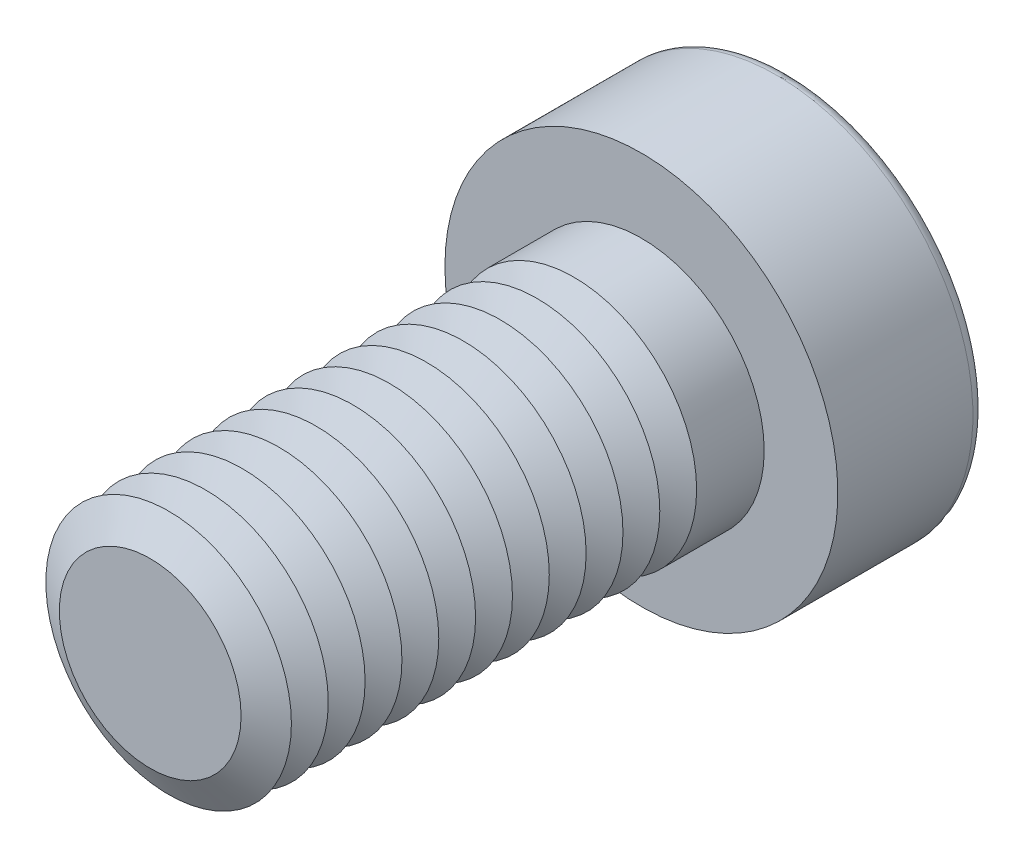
ISO-10303-21;
HEADER;
FILE_DESCRIPTION(('STEP AP214'),'2;1');
FILE_NAME('part.step','',(''),(''),'','','');
FILE_SCHEMA(('AUTOMOTIVE_DESIGN { 1 0 10303 214 1 1 1 1 }'));
ENDSEC;
DATA;
#1=APPLICATION_CONTEXT('core data for automotive mechanical design processes');
#2=APPLICATION_PROTOCOL_DEFINITION('international standard','automotive_design',2000,#1);
#3=PRODUCT_CONTEXT('',#1,'mechanical');
#4=PRODUCT('Part','Part','',(#3));
#5=PRODUCT_RELATED_PRODUCT_CATEGORY('part','',(#4));
#6=PRODUCT_DEFINITION_FORMATION('','',#4);
#7=PRODUCT_DEFINITION_CONTEXT('part definition',#1,'design');
#8=PRODUCT_DEFINITION('design','',#6,#7);
#9=PRODUCT_DEFINITION_SHAPE('','',#8);
#10=(LENGTH_UNIT() NAMED_UNIT(*) SI_UNIT(.MILLI.,.METRE.));
#11=(NAMED_UNIT(*) PLANE_ANGLE_UNIT() SI_UNIT($,.RADIAN.));
#12=(NAMED_UNIT(*) SI_UNIT($,.STERADIAN.) SOLID_ANGLE_UNIT());
#13=UNCERTAINTY_MEASURE_WITH_UNIT(LENGTH_MEASURE(1.E-05),#10,'distance_accuracy_value','');
#14=(GEOMETRIC_REPRESENTATION_CONTEXT(3) GLOBAL_UNCERTAINTY_ASSIGNED_CONTEXT((#13)) GLOBAL_UNIT_ASSIGNED_CONTEXT((#10,
#11,#12)) REPRESENTATION_CONTEXT('',''));
#15=CARTESIAN_POINT('',(0.,0.,0.));
#16=DIRECTION('',(0.,0.,1.));
#17=DIRECTION('',(1.,0.,0.));
#18=AXIS2_PLACEMENT_3D('',#15,#16,#17);
#19=CARTESIAN_POINT('',(0.,0.,14.75));
#20=DIRECTION('',(0.,0.,1.));
#21=DIRECTION('',(1.,0.,0.));
#22=AXIS2_PLACEMENT_3D('',#19,#20,#21);
#23=CONICAL_SURFACE('',#22,5.,1.0471975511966);
#24=CARTESIAN_POINT('',(0.,0.,14.));
#25=DIRECTION('',(0.,0.,1.));
#26=DIRECTION('',(1.,0.,0.));
#27=AXIS2_PLACEMENT_3D('',#24,#25,#26);
#28=CIRCLE('',#27,3.70096189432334);
#29=CARTESIAN_POINT('',(3.70096189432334,0.,14.));
#30=VERTEX_POINT('',#29);
#31=EDGE_CURVE('E311',#30,#30,#28,.T.);
#32=ORIENTED_EDGE('',*,*,#31,.T.);
#33=EDGE_LOOP('',(#32));
#34=FACE_BOUND('',#33,.T.);
#35=CARTESIAN_POINT('',(0.,0.,14.75));
#36=DIRECTION('',(0.,0.,1.));
#37=DIRECTION('',(1.,0.,0.));
#38=AXIS2_PLACEMENT_3D('',#35,#36,#37);
#39=CIRCLE('',#38,5.);
#40=CARTESIAN_POINT('',(5.,0.,14.75));
#41=VERTEX_POINT('',#40);
#42=EDGE_CURVE('E314',#41,#41,#39,.T.);
#43=ORIENTED_EDGE('',*,*,#42,.F.);
#44=EDGE_LOOP('',(#43));
#45=FACE_BOUND('',#44,.T.);
#46=ADVANCED_FACE('F39',(#34,#45),#23,.T.);
#47=CARTESIAN_POINT('',(0.,0.,14.));
#48=DIRECTION('',(0.,0.,-1.));
#49=DIRECTION('',(-1.,0.,0.));
#50=AXIS2_PLACEMENT_3D('',#47,#48,#49);
#51=CONICAL_SURFACE('',#50,3.70096189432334,1.0471975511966);
#52=CARTESIAN_POINT('',(0.,0.,13.25));
#53=DIRECTION('',(0.,0.,1.));
#54=DIRECTION('',(1.,0.,0.));
#55=AXIS2_PLACEMENT_3D('',#52,#53,#54);
#56=CIRCLE('',#55,5.);
#57=CARTESIAN_POINT('',(5.,0.,13.25));
#58=VERTEX_POINT('',#57);
#59=EDGE_CURVE('E322',#58,#58,#56,.T.);
#60=ORIENTED_EDGE('',*,*,#59,.T.);
#61=EDGE_LOOP('',(#60));
#62=FACE_BOUND('',#61,.T.);
#63=ORIENTED_EDGE('',*,*,#31,.F.);
#64=EDGE_LOOP('',(#63));
#65=FACE_BOUND('',#64,.T.);
#66=ADVANCED_FACE('F244',(#62,#65),#51,.T.);
#67=CARTESIAN_POINT('',(0.,0.,20.));
#68=DIRECTION('',(0.,0.,1.));
#69=DIRECTION('',(1.,0.,0.));
#70=AXIS2_PLACEMENT_3D('',#67,#68,#69);
#71=PLANE('',#70);
#72=CARTESIAN_POINT('',(0.,0.,20.));
#73=DIRECTION('',(0.,0.,1.));
#74=DIRECTION('',(1.,0.,0.));
#75=AXIS2_PLACEMENT_3D('',#72,#73,#74);
#76=CIRCLE('',#75,3.70096189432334);
#77=CARTESIAN_POINT('',(3.70096189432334,0.,20.));
#78=VERTEX_POINT('',#77);
#79=EDGE_CURVE('E173',#78,#78,#76,.T.);
#80=ORIENTED_EDGE('',*,*,#79,.T.);
#81=EDGE_LOOP('',(#80));
#82=FACE_BOUND('',#81,.T.);
#83=ADVANCED_FACE('F250',(#82),#71,.T.);
#84=CARTESIAN_POINT('',(0.,0.,20.));
#85=DIRECTION('',(0.,0.,-1.));
#86=DIRECTION('',(-1.,0.,0.));
#87=AXIS2_PLACEMENT_3D('',#84,#85,#86);
#88=CONICAL_SURFACE('',#87,3.70096189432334,1.0471975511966);
#89=CARTESIAN_POINT('',(0.,0.,19.25));
#90=DIRECTION('',(0.,0.,1.));
#91=DIRECTION('',(1.,0.,0.));
#92=AXIS2_PLACEMENT_3D('',#89,#90,#91);
#93=CIRCLE('',#92,5.);
#94=CARTESIAN_POINT('',(5.,0.,19.25));
#95=VERTEX_POINT('',#94);
#96=EDGE_CURVE('E290',#95,#95,#93,.T.);
#97=ORIENTED_EDGE('',*,*,#96,.T.);
#98=EDGE_LOOP('',(#97));
#99=FACE_BOUND('',#98,.T.);
#100=ORIENTED_EDGE('',*,*,#79,.F.);
#101=EDGE_LOOP('',(#100));
#102=FACE_BOUND('',#101,.T.);
#103=ADVANCED_FACE('F198',(#99,#102),#88,.T.);
#104=CARTESIAN_POINT('',(0.,0.,19.25));
#105=DIRECTION('',(0.,0.,1.));
#106=DIRECTION('',(1.,0.,0.));
#107=AXIS2_PLACEMENT_3D('',#104,#105,#106);
#108=CONICAL_SURFACE('',#107,5.,1.0471975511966);
#109=CARTESIAN_POINT('',(0.,0.,18.5));
#110=DIRECTION('',(0.,0.,1.));
#111=DIRECTION('',(1.,0.,0.));
#112=AXIS2_PLACEMENT_3D('',#109,#110,#111);
#113=CIRCLE('',#112,3.70096189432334);
#114=CARTESIAN_POINT('',(3.70096189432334,0.,18.5));
#115=VERTEX_POINT('',#114);
#116=EDGE_CURVE('E287',#115,#115,#113,.T.);
#117=ORIENTED_EDGE('',*,*,#116,.T.);
#118=EDGE_LOOP('',(#117));
#119=FACE_BOUND('',#118,.T.);
#120=ORIENTED_EDGE('',*,*,#96,.F.);
#121=EDGE_LOOP('',(#120));
#122=FACE_BOUND('',#121,.T.);
#123=ADVANCED_FACE('F276',(#119,#122),#108,.T.);
#124=CARTESIAN_POINT('',(0.,0.,18.5));
#125=DIRECTION('',(0.,0.,-1.));
#126=DIRECTION('',(-1.,0.,0.));
#127=AXIS2_PLACEMENT_3D('',#124,#125,#126);
#128=CONICAL_SURFACE('',#127,3.70096189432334,1.0471975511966);
#129=CARTESIAN_POINT('',(0.,0.,17.75));
#130=DIRECTION('',(0.,0.,1.));
#131=DIRECTION('',(1.,0.,0.));
#132=AXIS2_PLACEMENT_3D('',#129,#130,#131);
#133=CIRCLE('',#132,5.);
#134=CARTESIAN_POINT('',(5.,0.,17.75));
#135=VERTEX_POINT('',#134);
#136=EDGE_CURVE('E297',#135,#135,#133,.T.);
#137=ORIENTED_EDGE('',*,*,#136,.T.);
#138=EDGE_LOOP('',(#137));
#139=FACE_BOUND('',#138,.T.);
#140=ORIENTED_EDGE('',*,*,#116,.F.);
#141=EDGE_LOOP('',(#140));
#142=FACE_BOUND('',#141,.T.);
#143=ADVANCED_FACE('F273',(#139,#142),#128,.T.);
#144=CARTESIAN_POINT('',(0.,0.,17.75));
#145=DIRECTION('',(0.,0.,1.));
#146=DIRECTION('',(1.,0.,0.));
#147=AXIS2_PLACEMENT_3D('',#144,#145,#146);
#148=CONICAL_SURFACE('',#147,5.,1.0471975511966);
#149=CARTESIAN_POINT('',(0.,0.,17.));
#150=DIRECTION('',(0.,0.,1.));
#151=DIRECTION('',(1.,0.,0.));
#152=AXIS2_PLACEMENT_3D('',#149,#150,#151);
#153=CIRCLE('',#152,3.70096189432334);
#154=CARTESIAN_POINT('',(3.70096189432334,0.,17.));
#155=VERTEX_POINT('',#154);
#156=EDGE_CURVE('E292',#155,#155,#153,.T.);
#157=ORIENTED_EDGE('',*,*,#156,.T.);
#158=EDGE_LOOP('',(#157));
#159=FACE_BOUND('',#158,.T.);
#160=ORIENTED_EDGE('',*,*,#136,.F.);
#161=EDGE_LOOP('',(#160));
#162=FACE_BOUND('',#161,.T.);
#163=ADVANCED_FACE('F269',(#159,#162),#148,.T.);
#164=CARTESIAN_POINT('',(0.,0.,17.));
#165=DIRECTION('',(0.,0.,-1.));
#166=DIRECTION('',(-1.,0.,0.));
#167=AXIS2_PLACEMENT_3D('',#164,#165,#166);
#168=CONICAL_SURFACE('',#167,3.70096189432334,1.0471975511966);
#169=CARTESIAN_POINT('',(0.,0.,16.25));
#170=DIRECTION('',(0.,0.,1.));
#171=DIRECTION('',(1.,0.,0.));
#172=AXIS2_PLACEMENT_3D('',#169,#170,#171);
#173=CIRCLE('',#172,5.);
#174=CARTESIAN_POINT('',(5.,0.,16.25));
#175=VERTEX_POINT('',#174);
#176=EDGE_CURVE('E307',#175,#175,#173,.T.);
#177=ORIENTED_EDGE('',*,*,#176,.T.);
#178=EDGE_LOOP('',(#177));
#179=FACE_BOUND('',#178,.T.);
#180=ORIENTED_EDGE('',*,*,#156,.F.);
#181=EDGE_LOOP('',(#180));
#182=FACE_BOUND('',#181,.T.);
#183=ADVANCED_FACE('F265',(#179,#182),#168,.T.);
#184=CARTESIAN_POINT('',(0.,0.,16.25));
#185=DIRECTION('',(0.,0.,1.));
#186=DIRECTION('',(1.,0.,0.));
#187=AXIS2_PLACEMENT_3D('',#184,#185,#186);
#188=CONICAL_SURFACE('',#187,5.,1.0471975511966);
#189=CARTESIAN_POINT('',(0.,0.,15.5));
#190=DIRECTION('',(0.,0.,1.));
#191=DIRECTION('',(1.,0.,0.));
#192=AXIS2_PLACEMENT_3D('',#189,#190,#191);
#193=CIRCLE('',#192,3.70096189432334);
#194=CARTESIAN_POINT('',(3.70096189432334,0.,15.5));
#195=VERTEX_POINT('',#194);
#196=EDGE_CURVE('E303',#195,#195,#193,.T.);
#197=ORIENTED_EDGE('',*,*,#196,.T.);
#198=EDGE_LOOP('',(#197));
#199=FACE_BOUND('',#198,.T.);
#200=ORIENTED_EDGE('',*,*,#176,.F.);
#201=EDGE_LOOP('',(#200));
#202=FACE_BOUND('',#201,.T.);
#203=ADVANCED_FACE('F261',(#199,#202),#188,.T.);
#204=CARTESIAN_POINT('',(0.,0.,15.5));
#205=DIRECTION('',(0.,0.,-1.));
#206=DIRECTION('',(-1.,0.,0.));
#207=AXIS2_PLACEMENT_3D('',#204,#205,#206);
#208=CONICAL_SURFACE('',#207,3.70096189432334,1.0471975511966);
#209=ORIENTED_EDGE('',*,*,#42,.T.);
#210=EDGE_LOOP('',(#209));
#211=FACE_BOUND('',#210,.T.);
#212=ORIENTED_EDGE('',*,*,#196,.F.);
#213=EDGE_LOOP('',(#212));
#214=FACE_BOUND('',#213,.T.);
#215=ADVANCED_FACE('F257',(#211,#214),#208,.T.);
#216=CARTESIAN_POINT('',(0.,0.,13.25));
#217=DIRECTION('',(0.,0.,1.));
#218=DIRECTION('',(1.,0.,0.));
#219=AXIS2_PLACEMENT_3D('',#216,#217,#218);
#220=CONICAL_SURFACE('',#219,5.,1.0471975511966);
#221=CARTESIAN_POINT('',(0.,0.,12.5));
#222=DIRECTION('',(0.,0.,1.));
#223=DIRECTION('',(1.,0.,0.));
#224=AXIS2_PLACEMENT_3D('',#221,#222,#223);
#225=CIRCLE('',#224,3.70096189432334);
#226=CARTESIAN_POINT('',(3.70096189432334,0.,12.5));
#227=VERTEX_POINT('',#226);
#228=EDGE_CURVE('E318',#227,#227,#225,.T.);
#229=ORIENTED_EDGE('',*,*,#228,.T.);
#230=EDGE_LOOP('',(#229));
#231=FACE_BOUND('',#230,.T.);
#232=ORIENTED_EDGE('',*,*,#59,.F.);
#233=EDGE_LOOP('',(#232));
#234=FACE_BOUND('',#233,.T.);
#235=ADVANCED_FACE('F260',(#231,#234),#220,.T.);
#236=CARTESIAN_POINT('',(0.,0.,12.5));
#237=DIRECTION('',(0.,0.,-1.));
#238=DIRECTION('',(-1.,0.,0.));
#239=AXIS2_PLACEMENT_3D('',#236,#237,#238);
#240=CONICAL_SURFACE('',#239,3.70096189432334,1.0471975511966);
#241=CARTESIAN_POINT('',(0.,0.,11.75));
#242=DIRECTION('',(0.,0.,1.));
#243=DIRECTION('',(1.,0.,0.));
#244=AXIS2_PLACEMENT_3D('',#241,#242,#243);
#245=CIRCLE('',#244,5.);
#246=CARTESIAN_POINT('',(5.,0.,11.75));
#247=VERTEX_POINT('',#246);
#248=EDGE_CURVE('E330',#247,#247,#245,.T.);
#249=ORIENTED_EDGE('',*,*,#248,.T.);
#250=EDGE_LOOP('',(#249));
#251=FACE_BOUND('',#250,.T.);
#252=ORIENTED_EDGE('',*,*,#228,.F.);
#253=EDGE_LOOP('',(#252));
#254=FACE_BOUND('',#253,.T.);
#255=ADVANCED_FACE('F431',(#251,#254),#240,.T.);
#256=CARTESIAN_POINT('',(0.,0.,11.75));
#257=DIRECTION('',(0.,0.,1.));
#258=DIRECTION('',(1.,0.,0.));
#259=AXIS2_PLACEMENT_3D('',#256,#257,#258);
#260=CONICAL_SURFACE('',#259,5.,1.0471975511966);
#261=CARTESIAN_POINT('',(0.,0.,11.));
#262=DIRECTION('',(0.,0.,1.));
#263=DIRECTION('',(1.,0.,0.));
#264=AXIS2_PLACEMENT_3D('',#261,#262,#263);
#265=CIRCLE('',#264,3.70096189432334);
#266=CARTESIAN_POINT('',(3.70096189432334,0.,11.));
#267=VERTEX_POINT('',#266);
#268=EDGE_CURVE('E326',#267,#267,#265,.T.);
#269=ORIENTED_EDGE('',*,*,#268,.T.);
#270=EDGE_LOOP('',(#269));
#271=FACE_BOUND('',#270,.T.);
#272=ORIENTED_EDGE('',*,*,#248,.F.);
#273=EDGE_LOOP('',(#272));
#274=FACE_BOUND('',#273,.T.);
#275=ADVANCED_FACE('F427',(#271,#274),#260,.T.);
#276=CARTESIAN_POINT('',(0.,0.,11.));
#277=DIRECTION('',(0.,0.,-1.));
#278=DIRECTION('',(-1.,0.,0.));
#279=AXIS2_PLACEMENT_3D('',#276,#277,#278);
#280=CONICAL_SURFACE('',#279,3.70096189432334,1.0471975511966);
#281=CARTESIAN_POINT('',(0.,0.,10.25));
#282=DIRECTION('',(0.,0.,1.));
#283=DIRECTION('',(1.,0.,0.));
#284=AXIS2_PLACEMENT_3D('',#281,#282,#283);
#285=CIRCLE('',#284,5.);
#286=CARTESIAN_POINT('',(5.,0.,10.25));
#287=VERTEX_POINT('',#286);
#288=EDGE_CURVE('E338',#287,#287,#285,.T.);
#289=ORIENTED_EDGE('',*,*,#288,.T.);
#290=EDGE_LOOP('',(#289));
#291=FACE_BOUND('',#290,.T.);
#292=ORIENTED_EDGE('',*,*,#268,.F.);
#293=EDGE_LOOP('',(#292));
#294=FACE_BOUND('',#293,.T.);
#295=ADVANCED_FACE('F423',(#291,#294),#280,.T.);
#296=CARTESIAN_POINT('',(0.,0.,10.25));
#297=DIRECTION('',(0.,0.,1.));
#298=DIRECTION('',(1.,0.,0.));
#299=AXIS2_PLACEMENT_3D('',#296,#297,#298);
#300=CONICAL_SURFACE('',#299,5.,1.0471975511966);
#301=CARTESIAN_POINT('',(0.,0.,9.5));
#302=DIRECTION('',(0.,0.,1.));
#303=DIRECTION('',(1.,0.,0.));
#304=AXIS2_PLACEMENT_3D('',#301,#302,#303);
#305=CIRCLE('',#304,3.70096189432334);
#306=CARTESIAN_POINT('',(3.70096189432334,0.,9.5));
#307=VERTEX_POINT('',#306);
#308=EDGE_CURVE('E334',#307,#307,#305,.T.);
#309=ORIENTED_EDGE('',*,*,#308,.T.);
#310=EDGE_LOOP('',(#309));
#311=FACE_BOUND('',#310,.T.);
#312=ORIENTED_EDGE('',*,*,#288,.F.);
#313=EDGE_LOOP('',(#312));
#314=FACE_BOUND('',#313,.T.);
#315=ADVANCED_FACE('F419',(#311,#314),#300,.T.);
#316=CARTESIAN_POINT('',(0.,0.,9.5));
#317=DIRECTION('',(0.,0.,-1.));
#318=DIRECTION('',(-1.,0.,0.));
#319=AXIS2_PLACEMENT_3D('',#316,#317,#318);
#320=CONICAL_SURFACE('',#319,3.70096189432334,1.0471975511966);
#321=CARTESIAN_POINT('',(0.,0.,8.75));
#322=DIRECTION('',(0.,0.,1.));
#323=DIRECTION('',(1.,0.,0.));
#324=AXIS2_PLACEMENT_3D('',#321,#322,#323);
#325=CIRCLE('',#324,5.);
#326=CARTESIAN_POINT('',(5.,0.,8.75));
#327=VERTEX_POINT('',#326);
#328=EDGE_CURVE('E346',#327,#327,#325,.T.);
#329=ORIENTED_EDGE('',*,*,#328,.T.);
#330=EDGE_LOOP('',(#329));
#331=FACE_BOUND('',#330,.T.);
#332=ORIENTED_EDGE('',*,*,#308,.F.);
#333=EDGE_LOOP('',(#332));
#334=FACE_BOUND('',#333,.T.);
#335=ADVANCED_FACE('F415',(#331,#334),#320,.T.);
#336=CARTESIAN_POINT('',(0.,0.,8.75));
#337=DIRECTION('',(0.,0.,1.));
#338=DIRECTION('',(1.,0.,0.));
#339=AXIS2_PLACEMENT_3D('',#336,#337,#338);
#340=CONICAL_SURFACE('',#339,5.,1.0471975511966);
#341=CARTESIAN_POINT('',(0.,0.,8.));
#342=DIRECTION('',(0.,0.,1.));
#343=DIRECTION('',(1.,0.,0.));
#344=AXIS2_PLACEMENT_3D('',#341,#342,#343);
#345=CIRCLE('',#344,3.70096189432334);
#346=CARTESIAN_POINT('',(3.70096189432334,0.,8.));
#347=VERTEX_POINT('',#346);
#348=EDGE_CURVE('E342',#347,#347,#345,.T.);
#349=ORIENTED_EDGE('',*,*,#348,.T.);
#350=EDGE_LOOP('',(#349));
#351=FACE_BOUND('',#350,.T.);
#352=ORIENTED_EDGE('',*,*,#328,.F.);
#353=EDGE_LOOP('',(#352));
#354=FACE_BOUND('',#353,.T.);
#355=ADVANCED_FACE('F411',(#351,#354),#340,.T.);
#356=CARTESIAN_POINT('',(0.,0.,8.));
#357=DIRECTION('',(0.,0.,-1.));
#358=DIRECTION('',(-1.,0.,0.));
#359=AXIS2_PLACEMENT_3D('',#356,#357,#358);
#360=CONICAL_SURFACE('',#359,3.70096189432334,1.0471975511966);
#361=CARTESIAN_POINT('',(0.,0.,7.25));
#362=DIRECTION('',(0.,0.,1.));
#363=DIRECTION('',(1.,0.,0.));
#364=AXIS2_PLACEMENT_3D('',#361,#362,#363);
#365=CIRCLE('',#364,5.);
#366=CARTESIAN_POINT('',(5.,0.,7.25));
#367=VERTEX_POINT('',#366);
#368=EDGE_CURVE('E354',#367,#367,#365,.T.);
#369=ORIENTED_EDGE('',*,*,#368,.T.);
#370=EDGE_LOOP('',(#369));
#371=FACE_BOUND('',#370,.T.);
#372=ORIENTED_EDGE('',*,*,#348,.F.);
#373=EDGE_LOOP('',(#372));
#374=FACE_BOUND('',#373,.T.);
#375=ADVANCED_FACE('F407',(#371,#374),#360,.T.);
#376=CARTESIAN_POINT('',(0.,0.,7.25));
#377=DIRECTION('',(0.,0.,1.));
#378=DIRECTION('',(1.,0.,0.));
#379=AXIS2_PLACEMENT_3D('',#376,#377,#378);
#380=CONICAL_SURFACE('',#379,5.,1.0471975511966);
#381=CARTESIAN_POINT('',(0.,0.,6.5));
#382=DIRECTION('',(0.,0.,1.));
#383=DIRECTION('',(1.,0.,0.));
#384=AXIS2_PLACEMENT_3D('',#381,#382,#383);
#385=CIRCLE('',#384,3.70096189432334);
#386=CARTESIAN_POINT('',(3.70096189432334,0.,6.5));
#387=VERTEX_POINT('',#386);
#388=EDGE_CURVE('E350',#387,#387,#385,.T.);
#389=ORIENTED_EDGE('',*,*,#388,.T.);
#390=EDGE_LOOP('',(#389));
#391=FACE_BOUND('',#390,.T.);
#392=ORIENTED_EDGE('',*,*,#368,.F.);
#393=EDGE_LOOP('',(#392));
#394=FACE_BOUND('',#393,.T.);
#395=ADVANCED_FACE('F403',(#391,#394),#380,.T.);
#396=CARTESIAN_POINT('',(0.,0.,6.5));
#397=DIRECTION('',(0.,0.,-1.));
#398=DIRECTION('',(-1.,0.,0.));
#399=AXIS2_PLACEMENT_3D('',#396,#397,#398);
#400=CONICAL_SURFACE('',#399,3.70096189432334,1.0471975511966);
#401=CARTESIAN_POINT('',(0.,0.,5.75));
#402=DIRECTION('',(0.,0.,1.));
#403=DIRECTION('',(1.,0.,0.));
#404=AXIS2_PLACEMENT_3D('',#401,#402,#403);
#405=CIRCLE('',#404,5.);
#406=CARTESIAN_POINT('',(5.,0.,5.75));
#407=VERTEX_POINT('',#406);
#408=EDGE_CURVE('E361',#407,#407,#405,.T.);
#409=ORIENTED_EDGE('',*,*,#408,.T.);
#410=EDGE_LOOP('',(#409));
#411=FACE_BOUND('',#410,.T.);
#412=ORIENTED_EDGE('',*,*,#388,.F.);
#413=EDGE_LOOP('',(#412));
#414=FACE_BOUND('',#413,.T.);
#415=ADVANCED_FACE('F399',(#411,#414),#400,.T.);
#416=CARTESIAN_POINT('',(0.,0.,5.75));
#417=DIRECTION('',(0.,0.,1.));
#418=DIRECTION('',(1.,0.,0.));
#419=AXIS2_PLACEMENT_3D('',#416,#417,#418);
#420=CONICAL_SURFACE('',#419,5.,1.0471975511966);
#421=CARTESIAN_POINT('',(0.,0.,5.));
#422=DIRECTION('',(0.,0.,1.));
#423=DIRECTION('',(1.,0.,0.));
#424=AXIS2_PLACEMENT_3D('',#421,#422,#423);
#425=CIRCLE('',#424,3.70096189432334);
#426=CARTESIAN_POINT('',(3.70096189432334,0.,5.));
#427=VERTEX_POINT('',#426);
#428=EDGE_CURVE('E357',#427,#427,#425,.T.);
#429=ORIENTED_EDGE('',*,*,#428,.T.);
#430=EDGE_LOOP('',(#429));
#431=FACE_BOUND('',#430,.T.);
#432=ORIENTED_EDGE('',*,*,#408,.F.);
#433=EDGE_LOOP('',(#432));
#434=FACE_BOUND('',#433,.T.);
#435=ADVANCED_FACE('F394',(#431,#434),#420,.T.);
#436=CARTESIAN_POINT('',(0.,0.,5.));
#437=DIRECTION('',(0.,0.,-1.));
#438=DIRECTION('',(-1.,0.,0.));
#439=AXIS2_PLACEMENT_3D('',#436,#437,#438);
#440=CONICAL_SURFACE('',#439,3.70096189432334,1.0471975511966);
#441=CARTESIAN_POINT('',(0.,0.,4.25));
#442=DIRECTION('',(0.,0.,1.));
#443=DIRECTION('',(1.,0.,0.));
#444=AXIS2_PLACEMENT_3D('',#441,#442,#443);
#445=CIRCLE('',#444,5.);
#446=CARTESIAN_POINT('',(5.,0.,4.25));
#447=VERTEX_POINT('',#446);
#448=EDGE_CURVE('E373',#447,#447,#445,.T.);
#449=ORIENTED_EDGE('',*,*,#448,.T.);
#450=EDGE_LOOP('',(#449));
#451=FACE_BOUND('',#450,.T.);
#452=ORIENTED_EDGE('',*,*,#428,.F.);
#453=EDGE_LOOP('',(#452));
#454=FACE_BOUND('',#453,.T.);
#455=ADVANCED_FACE('F380',(#451,#454),#440,.T.);
#456=CARTESIAN_POINT('',(0.,0.,4.25));
#457=DIRECTION('',(0.,0.,1.));
#458=DIRECTION('',(1.,0.,0.));
#459=AXIS2_PLACEMENT_3D('',#456,#457,#458);
#460=CONICAL_SURFACE('',#459,5.,1.0471975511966);
#461=CARTESIAN_POINT('',(0.,0.,3.5));
#462=DIRECTION('',(0.,0.,1.));
#463=DIRECTION('',(1.,0.,0.));
#464=AXIS2_PLACEMENT_3D('',#461,#462,#463);
#465=CIRCLE('',#464,3.70096189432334);
#466=CARTESIAN_POINT('',(3.70096189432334,0.,3.5));
#467=VERTEX_POINT('',#466);
#468=EDGE_CURVE('E365',#467,#467,#465,.T.);
#469=ORIENTED_EDGE('',*,*,#468,.T.);
#470=EDGE_LOOP('',(#469));
#471=FACE_BOUND('',#470,.T.);
#472=ORIENTED_EDGE('',*,*,#448,.F.);
#473=EDGE_LOOP('',(#472));
#474=FACE_BOUND('',#473,.T.);
#475=ADVANCED_FACE('F383',(#471,#474),#460,.T.);
#476=CARTESIAN_POINT('',(0.,0.,3.5));
#477=DIRECTION('',(0.,0.,-1.));
#478=DIRECTION('',(-1.,0.,0.));
#479=AXIS2_PLACEMENT_3D('',#476,#477,#478);
#480=CONICAL_SURFACE('',#479,3.70096189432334,1.0471975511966);
#481=CARTESIAN_POINT('',(0.,0.,2.75));
#482=DIRECTION('',(0.,0.,1.));
#483=DIRECTION('',(1.,0.,0.));
#484=AXIS2_PLACEMENT_3D('',#481,#482,#483);
#485=CIRCLE('',#484,5.);
#486=CARTESIAN_POINT('',(5.,0.,2.75));
#487=VERTEX_POINT('',#486);
#488=EDGE_CURVE('E369',#487,#487,#485,.T.);
#489=ORIENTED_EDGE('',*,*,#488,.T.);
#490=EDGE_LOOP('',(#489));
#491=FACE_BOUND('',#490,.T.);
#492=ORIENTED_EDGE('',*,*,#468,.F.);
#493=EDGE_LOOP('',(#492));
#494=FACE_BOUND('',#493,.T.);
#495=ADVANCED_FACE('F385',(#491,#494),#480,.T.);
#496=CARTESIAN_POINT('',(0.,0.,-0.75));
#497=DIRECTION('',(0.,0.,-1.));
#498=DIRECTION('',(-1.,0.,0.));
#499=AXIS2_PLACEMENT_3D('',#496,#497,#498);
#500=CONICAL_SURFACE('',#499,3.5,1.0471975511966);
#501=CARTESIAN_POINT('',(0.,0.,1.27072594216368));
#502=VERTEX_POINT('',#501);
#503=VERTEX_LOOP('',#502);
#504=FACE_BOUND('',#503,.T.);
#505=CARTESIAN_POINT('',(0.,0.,-0.75));
#506=DIRECTION('',(0.,0.,-1.));
#507=DIRECTION('',(-1.,0.,0.));
#508=AXIS2_PLACEMENT_3D('',#505,#506,#507);
#509=CIRCLE('',#508,3.5);
#510=CARTESIAN_POINT('',(-3.03108891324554,1.75,-0.75));
#511=VERTEX_POINT('',#510);
#512=CARTESIAN_POINT('',(0.,3.5,-0.75));
#513=VERTEX_POINT('',#512);
#514=EDGE_CURVE('E149',#511,#513,#509,.T.);
#515=ORIENTED_EDGE('',*,*,#514,.T.);
#516=CARTESIAN_POINT('',(0.,0.,-0.75));
#517=DIRECTION('',(0.,0.,-1.));
#518=DIRECTION('',(-1.,0.,0.));
#519=AXIS2_PLACEMENT_3D('',#516,#517,#518);
#520=CIRCLE('',#519,3.5);
#521=CARTESIAN_POINT('',(3.03108891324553,1.75,-0.75));
#522=VERTEX_POINT('',#521);
#523=EDGE_CURVE('E54',#513,#522,#520,.T.);
#524=ORIENTED_EDGE('',*,*,#523,.T.);
#525=CARTESIAN_POINT('',(3.03108891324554,-1.75,-0.75));
#526=VERTEX_POINT('',#525);
#527=EDGE_CURVE('E876',#522,#526,#520,.T.);
#528=ORIENTED_EDGE('',*,*,#527,.T.);
#529=CARTESIAN_POINT('',(0.,-3.5,-0.75));
#530=VERTEX_POINT('',#529);
#531=EDGE_CURVE('E875',#526,#530,#520,.T.);
#532=ORIENTED_EDGE('',*,*,#531,.T.);
#533=CARTESIAN_POINT('',(-3.03108891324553,-1.75,-0.75));
#534=VERTEX_POINT('',#533);
#535=EDGE_CURVE('E870',#530,#534,#520,.T.);
#536=ORIENTED_EDGE('',*,*,#535,.T.);
#537=EDGE_CURVE('E869',#534,#511,#520,.T.);
#538=ORIENTED_EDGE('',*,*,#537,.T.);
#539=EDGE_LOOP('',(#515,#524,#528,#532,#536,#538));
#540=FACE_BOUND('',#539,.T.);
#541=ADVANCED_FACE('F200',(#504,#540),#500,.F.);
#542=CARTESIAN_POINT('',(0.,0.,-0.75));
#543=DIRECTION('',(0.,0.,-1.));
#544=DIRECTION('',(-1.,0.,0.));
#545=AXIS2_PLACEMENT_3D('',#542,#543,#544);
#546=PLANE('',#545);
#547=ORIENTED_EDGE('',*,*,#523,.F.);
#548=DIRECTION('',(1.,0.,0.));
#549=VECTOR('',#548,1.);
#550=CARTESIAN_POINT('',(-2.02072594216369,3.5,-0.75));
#551=LINE('',#550,#549);
#552=CARTESIAN_POINT('',(2.02072594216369,3.5,-0.75));
#553=VERTEX_POINT('',#552);
#554=EDGE_CURVE('E919',#513,#553,#551,.T.);
#555=ORIENTED_EDGE('',*,*,#554,.T.);
#556=DIRECTION('',(0.5,-0.866025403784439,0.));
#557=VECTOR('',#556,1.);
#558=CARTESIAN_POINT('',(2.02072594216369,3.5,-0.75));
#559=LINE('',#558,#557);
#560=EDGE_CURVE('E155',#553,#522,#559,.T.);
#561=ORIENTED_EDGE('',*,*,#560,.T.);
#562=EDGE_LOOP('',(#547,#555,#561));
#563=FACE_BOUND('',#562,.T.);
#564=ADVANCED_FACE('F496',(#563),#546,.T.);
#565=ORIENTED_EDGE('',*,*,#527,.F.);
#566=CARTESIAN_POINT('',(4.04145188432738,0.,-0.75));
#567=VERTEX_POINT('',#566);
#568=EDGE_CURVE('E914',#522,#567,#559,.T.);
#569=ORIENTED_EDGE('',*,*,#568,.T.);
#570=DIRECTION('',(-0.5,-0.866025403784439,0.));
#571=VECTOR('',#570,1.);
#572=CARTESIAN_POINT('',(4.04145188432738,0.,-0.75));
#573=LINE('',#572,#571);
#574=EDGE_CURVE('E887',#567,#526,#573,.T.);
#575=ORIENTED_EDGE('',*,*,#574,.T.);
#576=EDGE_LOOP('',(#565,#569,#575));
#577=FACE_BOUND('',#576,.T.);
#578=ADVANCED_FACE('F506',(#577),#546,.T.);
#579=ORIENTED_EDGE('',*,*,#531,.F.);
#580=CARTESIAN_POINT('',(2.02072594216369,-3.5,-0.75));
#581=VERTEX_POINT('',#580);
#582=EDGE_CURVE('E889',#526,#581,#573,.T.);
#583=ORIENTED_EDGE('',*,*,#582,.T.);
#584=DIRECTION('',(-1.,0.,0.));
#585=VECTOR('',#584,1.);
#586=CARTESIAN_POINT('',(2.02072594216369,-3.5,-0.75));
#587=LINE('',#586,#585);
#588=EDGE_CURVE('E843',#581,#530,#587,.T.);
#589=ORIENTED_EDGE('',*,*,#588,.T.);
#590=EDGE_LOOP('',(#579,#583,#589));
#591=FACE_BOUND('',#590,.T.);
#592=ADVANCED_FACE('F516',(#591),#546,.T.);
#593=ORIENTED_EDGE('',*,*,#535,.F.);
#594=CARTESIAN_POINT('',(-2.02072594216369,-3.5,-0.75));
#595=VERTEX_POINT('',#594);
#596=EDGE_CURVE('E883',#530,#595,#587,.T.);
#597=ORIENTED_EDGE('',*,*,#596,.T.);
#598=DIRECTION('',(-0.5,0.866025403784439,0.));
#599=VECTOR('',#598,1.);
#600=CARTESIAN_POINT('',(-2.02072594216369,-3.5,-0.75));
#601=LINE('',#600,#599);
#602=EDGE_CURVE('E885',#595,#534,#601,.T.);
#603=ORIENTED_EDGE('',*,*,#602,.T.);
#604=EDGE_LOOP('',(#593,#597,#603));
#605=FACE_BOUND('',#604,.T.);
#606=ADVANCED_FACE('F524',(#605),#546,.T.);
#607=ORIENTED_EDGE('',*,*,#537,.F.);
#608=CARTESIAN_POINT('',(-4.04145188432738,0.,-0.75));
#609=VERTEX_POINT('',#608);
#610=EDGE_CURVE('E891',#534,#609,#601,.T.);
#611=ORIENTED_EDGE('',*,*,#610,.T.);
#612=DIRECTION('',(0.5,0.866025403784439,0.));
#613=VECTOR('',#612,1.);
#614=CARTESIAN_POINT('',(-4.04145188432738,0.,-0.75));
#615=LINE('',#614,#613);
#616=EDGE_CURVE('E158',#609,#511,#615,.T.);
#617=ORIENTED_EDGE('',*,*,#616,.T.);
#618=EDGE_LOOP('',(#607,#611,#617));
#619=FACE_BOUND('',#618,.T.);
#620=ADVANCED_FACE('F230',(#619),#546,.T.);
#621=ORIENTED_EDGE('',*,*,#514,.F.);
#622=CARTESIAN_POINT('',(-2.02072594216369,3.5,-0.75));
#623=VERTEX_POINT('',#622);
#624=EDGE_CURVE('E897',#511,#623,#615,.T.);
#625=ORIENTED_EDGE('',*,*,#624,.T.);
#626=EDGE_CURVE('E916',#623,#513,#551,.T.);
#627=ORIENTED_EDGE('',*,*,#626,.T.);
#628=EDGE_LOOP('',(#621,#625,#627));
#629=FACE_BOUND('',#628,.T.);
#630=ADVANCED_FACE('F508',(#629),#546,.T.);
#631=CARTESIAN_POINT('',(-2.02072594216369,3.5,-0.75));
#632=DIRECTION('',(0.,1.,0.));
#633=DIRECTION('',(-1.,0.,0.));
#634=AXIS2_PLACEMENT_3D('',#631,#632,#633);
#635=PLANE('',#634);
#636=DIRECTION('',(0.,0.,-1.));
#637=VECTOR('',#636,1.);
#638=CARTESIAN_POINT('',(-2.02072594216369,3.5,-0.75));
#639=LINE('',#638,#637);
#640=CARTESIAN_POINT('',(-2.02072594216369,3.5,-6.));
#641=VERTEX_POINT('',#640);
#642=EDGE_CURVE('E147',#623,#641,#639,.T.);
#643=ORIENTED_EDGE('',*,*,#642,.T.);
#644=CARTESIAN_POINT('',(-5.27521327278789,3.5,-6.613404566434));
#645=CARTESIAN_POINT('',(-5.11717138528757,3.5,-6.57812703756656));
#646=CARTESIAN_POINT('',(-4.95902873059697,3.5,-6.5432936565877));
#647=CARTESIAN_POINT('',(-4.64249233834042,3.5,-6.47475322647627));
#648=CARTESIAN_POINT('',(-4.48409858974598,3.5,-6.44104622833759));
#649=CARTESIAN_POINT('',(-4.16686075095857,3.5,-6.37496567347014));
#650=CARTESIAN_POINT('',(-4.00801636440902,3.5,-6.34259353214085));
#651=CARTESIAN_POINT('',(-3.68999232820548,3.5,-6.27954992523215));
#652=CARTESIAN_POINT('',(-3.53081268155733,3.5,-6.24887844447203));
#653=CARTESIAN_POINT('',(-3.05545711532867,3.5,-6.16049717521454));
#654=CARTESIAN_POINT('',(-2.73870333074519,3.5,-6.10583257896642));
#655=CARTESIAN_POINT('',(-2.10326379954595,3.5,-6.00899390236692));
#656=CARTESIAN_POINT('',(-1.78457845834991,3.5,-5.9668172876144));
#657=CARTESIAN_POINT('',(-1.30331397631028,3.5,-5.91703310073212));
#658=CARTESIAN_POINT('',(-1.14143900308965,3.5,-5.90264327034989));
#659=CARTESIAN_POINT('',(-0.817296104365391,3.5,-5.87924021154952));
#660=CARTESIAN_POINT('',(-0.655028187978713,3.5,-5.87022685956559));
#661=CARTESIAN_POINT('',(-0.330337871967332,3.5,-5.8581019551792));
#662=CARTESIAN_POINT('',(-0.167915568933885,3.5,-5.85498786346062));
#663=CARTESIAN_POINT('',(0.156931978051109,3.5,-5.85485125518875));
#664=CARTESIAN_POINT('',(0.319357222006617,3.5,-5.8578287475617));
#665=CARTESIAN_POINT('',(0.644649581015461,3.5,-5.86971076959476));
#666=CARTESIAN_POINT('',(0.807515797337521,3.5,-5.87863941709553));
#667=CARTESIAN_POINT('',(1.13286152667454,3.5,-5.90192432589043));
#668=CARTESIAN_POINT('',(1.29534101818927,3.5,-5.91628088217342));
#669=CARTESIAN_POINT('',(1.61990955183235,3.5,-5.94971371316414));
#670=CARTESIAN_POINT('',(1.78199828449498,3.5,-5.96879294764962));
#671=CARTESIAN_POINT('',(2.10565606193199,3.5,-6.01089893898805));
#672=CARTESIAN_POINT('',(2.26722510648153,3.5,-6.03392569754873));
#673=CARTESIAN_POINT('',(2.59408673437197,3.5,-6.08385328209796));
#674=CARTESIAN_POINT('',(2.75936612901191,3.5,-6.11083971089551));
#675=CARTESIAN_POINT('',(3.08945524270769,3.5,-6.16755337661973));
#676=CARTESIAN_POINT('',(3.25426494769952,3.5,-6.19728069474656));
#677=CARTESIAN_POINT('',(3.74811783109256,3.5,-6.28973245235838));
#678=CARTESIAN_POINT('',(4.07654810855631,3.5,-6.35572082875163));
#679=CARTESIAN_POINT('',(4.73230999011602,3.5,-6.49329874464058));
#680=CARTESIAN_POINT('',(5.05964125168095,3.5,-6.56488988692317));
#681=CARTESIAN_POINT('',(5.71347161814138,3.5,-6.71179760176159));
#682=CARTESIAN_POINT('',(6.03997070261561,3.5,-6.78711426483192));
#683=CARTESIAN_POINT('',(6.68838444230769,3.5,-6.93936666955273));
#684=CARTESIAN_POINT('',(7.01030641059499,3.5,-7.01627142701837));
#685=CARTESIAN_POINT('',(7.65372712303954,3.5,-7.17185944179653));
#686=CARTESIAN_POINT('',(7.97522585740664,3.5,-7.25054273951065));
#687=CARTESIAN_POINT('',(8.61745492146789,3.5,-7.409094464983));
#688=CARTESIAN_POINT('',(8.93818569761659,3.5,-7.48896108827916));
#689=CARTESIAN_POINT('',(9.57938765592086,3.5,-7.64968154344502));
#690=CARTESIAN_POINT('',(9.89985884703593,3.5,-7.73053533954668));
#691=CARTESIAN_POINT('',(10.2202418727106,3.5,-7.81173318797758));
#692=B_SPLINE_CURVE_WITH_KNOTS('',3,(#644,#645,#646,#647,#648,#649,#650,#651,#652,#653,#654,
#655,#656,#657,#658,#659,#660,#661,#662,#663,#664,#665,#666,#667,#668,#669,#670,#671,#672,#673,
#674,#675,#676,#677,#678,#679,#680,#681,#682,#683,#684,#685,#686,#687,#688,#689,#690,#691),
.UNSPECIFIED.,.F.,.F.,(4,2,2,2,2,2,2,2,2,2,2,2,2,2,2,2,2,2,2,2,2,2,2,4),(0.,0.485795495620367,
0.971612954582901,1.45793295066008,1.94424860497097,2.90841266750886,3.87238092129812,
4.35984584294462,4.84729956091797,5.33454340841,5.82178796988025,6.31101925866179,
6.80027713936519,7.28984242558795,7.77940792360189,8.28178329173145,8.78417354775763,
9.78906542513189,10.7942458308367,11.7994506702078,12.7923858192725,13.7853435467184,
14.7769174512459,15.7684555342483),.UNSPECIFIED.);
#693=CARTESIAN_POINT('',(2.02072594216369,3.5,-6.));
#694=VERTEX_POINT('',#693);
#695=EDGE_CURVE('E124',#641,#694,#692,.T.);
#696=ORIENTED_EDGE('',*,*,#695,.T.);
#697=DIRECTION('',(0.,0.,-1.));
#698=VECTOR('',#697,1.);
#699=CARTESIAN_POINT('',(2.02072594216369,3.5,-0.75));
#700=LINE('',#699,#698);
#701=EDGE_CURVE('E143',#553,#694,#700,.T.);
#702=ORIENTED_EDGE('',*,*,#701,.F.);
#703=ORIENTED_EDGE('',*,*,#554,.F.);
#704=ORIENTED_EDGE('',*,*,#626,.F.);
#705=EDGE_LOOP('',(#643,#696,#702,#703,#704));
#706=FACE_BOUND('',#705,.T.);
#707=ADVANCED_FACE('F141',(#706),#635,.F.);
#708=CARTESIAN_POINT('',(2.02072594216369,3.5,-0.75));
#709=DIRECTION('',(0.866025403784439,0.5,0.));
#710=DIRECTION('',(-0.5,0.866025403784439,0.));
#711=AXIS2_PLACEMENT_3D('',#708,#709,#710);
#712=PLANE('',#711);
#713=ORIENTED_EDGE('',*,*,#701,.T.);
#714=CARTESIAN_POINT('',(2.02061047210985,3.5002,-6.00003094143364));
#715=CARTESIAN_POINT('',(2.10453570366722,3.35483723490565,-5.97753281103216));
#716=CARTESIAN_POINT('',(2.18861311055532,3.20921089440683,-5.95710815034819));
#717=CARTESIAN_POINT('',(2.35706487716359,2.91744387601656,-5.92122385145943));
#718=CARTESIAN_POINT('',(2.44143934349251,2.77130301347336,-5.90576623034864));
#719=CARTESIAN_POINT('',(2.6099736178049,2.47939308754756,-5.88071849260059));
#720=CARTESIAN_POINT('',(2.69413228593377,2.33362599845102,-5.87109850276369));
#721=CARTESIAN_POINT('',(2.86255695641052,2.04190591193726,-5.85819907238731));
#722=CARTESIAN_POINT('',(2.94682293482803,1.89595295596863,-5.85491840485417));
#723=CARTESIAN_POINT('',(3.11535489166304,1.60404704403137,-5.85491840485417));
#724=CARTESIAN_POINT('',(3.19962087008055,1.45809408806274,-5.85819907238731));
#725=CARTESIAN_POINT('',(3.3680455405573,1.16637400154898,-5.87109850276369));
#726=CARTESIAN_POINT('',(3.45220420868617,1.02060691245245,-5.88071849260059));
#727=CARTESIAN_POINT('',(3.62073848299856,0.728696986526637,-5.90576623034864));
#728=CARTESIAN_POINT('',(3.70511294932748,0.582556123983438,-5.92122385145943));
#729=CARTESIAN_POINT('',(3.87356471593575,0.290789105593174,-5.95710815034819));
#730=CARTESIAN_POINT('',(3.95764212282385,0.145162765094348,-5.97753281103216));
#731=CARTESIAN_POINT('',(4.04156735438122,-0.000199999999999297,-6.00003094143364));
#732=B_SPLINE_CURVE_WITH_KNOTS('',3,(#714,#715,#716,#717,#718,#719,#720,#721,#722,#723,#724,
#725,#726,#727,#728,#729,#730,#731),.UNSPECIFIED.,.F.,.F.,(4,2,2,2,2,2,2,2,4),(0.,
0.508081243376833,1.01636855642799,1.52203235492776,2.02759827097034,2.53316418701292,
3.03882798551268,3.54711529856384,4.05519654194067),.UNSPECIFIED.);
#733=CARTESIAN_POINT('',(4.04145188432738,0.,-6.));
#734=VERTEX_POINT('',#733);
#735=EDGE_CURVE('E11',#694,#734,#732,.T.);
#736=ORIENTED_EDGE('',*,*,#735,.T.);
#737=DIRECTION('',(0.,0.,-1.));
#738=VECTOR('',#737,1.);
#739=CARTESIAN_POINT('',(4.04145188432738,0.,-0.75));
#740=LINE('',#739,#738);
#741=EDGE_CURVE('E157',#567,#734,#740,.T.);
#742=ORIENTED_EDGE('',*,*,#741,.F.);
#743=ORIENTED_EDGE('',*,*,#568,.F.);
#744=ORIENTED_EDGE('',*,*,#560,.F.);
#745=EDGE_LOOP('',(#713,#736,#742,#743,#744));
#746=FACE_BOUND('',#745,.T.);
#747=ADVANCED_FACE('F152',(#746),#712,.F.);
#748=CARTESIAN_POINT('',(4.04145188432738,0.,-0.75));
#749=DIRECTION('',(0.866025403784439,-0.5,0.));
#750=DIRECTION('',(0.5,0.866025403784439,0.));
#751=AXIS2_PLACEMENT_3D('',#748,#749,#750);
#752=PLANE('',#751);
#753=ORIENTED_EDGE('',*,*,#741,.T.);
#754=CARTESIAN_POINT('',(4.04156735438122,0.000200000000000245,-6.00003094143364));
#755=CARTESIAN_POINT('',(3.95764212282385,-0.145162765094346,-5.97753281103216));
#756=CARTESIAN_POINT('',(3.87356471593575,-0.290789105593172,-5.95710815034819));
#757=CARTESIAN_POINT('',(3.70511294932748,-0.582556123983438,-5.92122385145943));
#758=CARTESIAN_POINT('',(3.62073848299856,-0.728696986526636,-5.90576623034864));
#759=CARTESIAN_POINT('',(3.45220420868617,-1.02060691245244,-5.88071849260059));
#760=CARTESIAN_POINT('',(3.3680455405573,-1.16637400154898,-5.87109850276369));
#761=CARTESIAN_POINT('',(3.19962087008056,-1.45809408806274,-5.85819907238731));
#762=CARTESIAN_POINT('',(3.11535489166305,-1.60404704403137,-5.85491840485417));
#763=CARTESIAN_POINT('',(2.94682293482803,-1.89595295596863,-5.85491840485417));
#764=CARTESIAN_POINT('',(2.86255695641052,-2.04190591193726,-5.85819907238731));
#765=CARTESIAN_POINT('',(2.69413228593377,-2.33362599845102,-5.87109850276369));
#766=CARTESIAN_POINT('',(2.6099736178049,-2.47939308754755,-5.88071849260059));
#767=CARTESIAN_POINT('',(2.44143934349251,-2.77130301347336,-5.90576623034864));
#768=CARTESIAN_POINT('',(2.35706487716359,-2.91744387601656,-5.92122385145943));
#769=CARTESIAN_POINT('',(2.18861311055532,-3.20921089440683,-5.95710815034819));
#770=CARTESIAN_POINT('',(2.10453570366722,-3.35483723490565,-5.97753281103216));
#771=CARTESIAN_POINT('',(2.02061047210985,-3.5002,-6.00003094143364));
#772=B_SPLINE_CURVE_WITH_KNOTS('',3,(#754,#755,#756,#757,#758,#759,#760,#761,#762,#763,#764,
#765,#766,#767,#768,#769,#770,#771),.UNSPECIFIED.,.F.,.F.,(4,2,2,2,2,2,2,2,4),(0.,
0.508081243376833,1.01636855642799,1.52203235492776,2.02759827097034,2.53316418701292,
3.03882798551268,3.54711529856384,4.05519654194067),.UNSPECIFIED.);
#773=CARTESIAN_POINT('',(2.02072594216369,-3.5,-6.));
#774=VERTEX_POINT('',#773);
#775=EDGE_CURVE('E172',#734,#774,#772,.T.);
#776=ORIENTED_EDGE('',*,*,#775,.T.);
#777=DIRECTION('',(0.,0.,-1.));
#778=VECTOR('',#777,1.);
#779=CARTESIAN_POINT('',(2.02072594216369,-3.5,-0.75));
#780=LINE('',#779,#778);
#781=EDGE_CURVE('E838',#581,#774,#780,.T.);
#782=ORIENTED_EDGE('',*,*,#781,.F.);
#783=ORIENTED_EDGE('',*,*,#582,.F.);
#784=ORIENTED_EDGE('',*,*,#574,.F.);
#785=EDGE_LOOP('',(#753,#776,#782,#783,#784));
#786=FACE_BOUND('',#785,.T.);
#787=ADVANCED_FACE('F190',(#786),#752,.F.);
#788=CARTESIAN_POINT('',(2.02072594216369,-3.5,-0.75));
#789=DIRECTION('',(0.,-1.,0.));
#790=DIRECTION('',(1.,0.,0.));
#791=AXIS2_PLACEMENT_3D('',#788,#789,#790);
#792=PLANE('',#791);
#793=ORIENTED_EDGE('',*,*,#781,.T.);
#794=CARTESIAN_POINT('',(-5.27521327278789,-3.5,-6.613404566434));
#795=CARTESIAN_POINT('',(-5.11717138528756,-3.5,-6.57812703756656));
#796=CARTESIAN_POINT('',(-4.95902873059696,-3.5,-6.5432936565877));
#797=CARTESIAN_POINT('',(-4.64249233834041,-3.5,-6.47475322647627));
#798=CARTESIAN_POINT('',(-4.48409858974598,-3.5,-6.44104622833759));
#799=CARTESIAN_POINT('',(-4.16686075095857,-3.5,-6.37496567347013));
#800=CARTESIAN_POINT('',(-4.00801636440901,-3.5,-6.34259353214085));
#801=CARTESIAN_POINT('',(-3.68999232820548,-3.5,-6.27954992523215));
#802=CARTESIAN_POINT('',(-3.53081268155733,-3.5,-6.24887844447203));
#803=CARTESIAN_POINT('',(-3.05545711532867,-3.5,-6.16049717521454));
#804=CARTESIAN_POINT('',(-2.73870333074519,-3.5,-6.10583257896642));
#805=CARTESIAN_POINT('',(-2.10326379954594,-3.5,-6.00899390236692));
#806=CARTESIAN_POINT('',(-1.78457845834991,-3.5,-5.9668172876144));
#807=CARTESIAN_POINT('',(-1.30331397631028,-3.5,-5.91703310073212));
#808=CARTESIAN_POINT('',(-1.14143900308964,-3.5,-5.90264327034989));
#809=CARTESIAN_POINT('',(-0.81729610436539,-3.5,-5.87924021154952));
#810=CARTESIAN_POINT('',(-0.655028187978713,-3.5,-5.87022685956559));
#811=CARTESIAN_POINT('',(-0.330337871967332,-3.5,-5.8581019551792));
#812=CARTESIAN_POINT('',(-0.167915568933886,-3.5,-5.85498786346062));
#813=CARTESIAN_POINT('',(0.156931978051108,-3.5,-5.85485125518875));
#814=CARTESIAN_POINT('',(0.319357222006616,-3.5,-5.8578287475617));
#815=CARTESIAN_POINT('',(0.64464958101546,-3.5,-5.86971076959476));
#816=CARTESIAN_POINT('',(0.807515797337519,-3.5,-5.87863941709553));
#817=CARTESIAN_POINT('',(1.13286152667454,-3.5,-5.90192432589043));
#818=CARTESIAN_POINT('',(1.29534101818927,-3.5,-5.91628088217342));
#819=CARTESIAN_POINT('',(1.61990955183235,-3.5,-5.94971371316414));
#820=CARTESIAN_POINT('',(1.78199828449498,-3.5,-5.96879294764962));
#821=CARTESIAN_POINT('',(2.10565606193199,-3.5,-6.01089893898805));
#822=CARTESIAN_POINT('',(2.26722510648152,-3.5,-6.03392569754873));
#823=CARTESIAN_POINT('',(2.59408673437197,-3.5,-6.08385328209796));
#824=CARTESIAN_POINT('',(2.75936612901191,-3.5,-6.11083971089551));
#825=CARTESIAN_POINT('',(3.08945524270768,-3.5,-6.16755337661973));
#826=CARTESIAN_POINT('',(3.25426494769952,-3.5,-6.19728069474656));
#827=CARTESIAN_POINT('',(3.74811783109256,-3.5,-6.28973245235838));
#828=CARTESIAN_POINT('',(4.0765481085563,-3.5,-6.35572082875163));
#829=CARTESIAN_POINT('',(4.73230999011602,-3.5,-6.49329874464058));
#830=CARTESIAN_POINT('',(5.05964125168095,-3.5,-6.56488988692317));
#831=CARTESIAN_POINT('',(5.71347161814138,-3.5,-6.71179760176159));
#832=CARTESIAN_POINT('',(6.03997070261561,-3.5,-6.78711426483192));
#833=CARTESIAN_POINT('',(6.68838444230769,-3.5,-6.93936666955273));
#834=CARTESIAN_POINT('',(7.01030641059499,-3.5,-7.01627142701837));
#835=CARTESIAN_POINT('',(7.65372712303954,-3.5,-7.17185944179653));
#836=CARTESIAN_POINT('',(7.97522585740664,-3.5,-7.25054273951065));
#837=CARTESIAN_POINT('',(8.61745492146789,-3.5,-7.409094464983));
#838=CARTESIAN_POINT('',(8.93818569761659,-3.5,-7.48896108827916));
#839=CARTESIAN_POINT('',(9.57938765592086,-3.5,-7.64968154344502));
#840=CARTESIAN_POINT('',(9.89985884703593,-3.5,-7.73053533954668));
#841=CARTESIAN_POINT('',(10.2202418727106,-3.5,-7.81173318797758));
#842=B_SPLINE_CURVE_WITH_KNOTS('',3,(#794,#795,#796,#797,#798,#799,#800,#801,#802,#803,#804,
#805,#806,#807,#808,#809,#810,#811,#812,#813,#814,#815,#816,#817,#818,#819,#820,#821,#822,#823,
#824,#825,#826,#827,#828,#829,#830,#831,#832,#833,#834,#835,#836,#837,#838,#839,#840,#841),
.UNSPECIFIED.,.F.,.F.,(4,2,2,2,2,2,2,2,2,2,2,2,2,2,2,2,2,2,2,2,2,2,2,4),(0.,0.485795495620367,
0.971612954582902,1.45793295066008,1.94424860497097,2.90841266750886,3.87238092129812,
4.35984584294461,4.84729956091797,5.33454340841,5.82178796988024,6.31101925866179,
6.80027713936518,7.28984242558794,7.77940792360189,8.28178329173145,8.78417354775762,
9.78906542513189,10.7942458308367,11.7994506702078,12.7923858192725,13.7853435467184,
14.7769174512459,15.7684555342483),.UNSPECIFIED.);
#843=CARTESIAN_POINT('',(-2.02072594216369,-3.5,-6.));
#844=VERTEX_POINT('',#843);
#845=EDGE_CURVE('E183',#774,#844,#842,.F.);
#846=ORIENTED_EDGE('',*,*,#845,.T.);
#847=DIRECTION('',(0.,0.,-1.));
#848=VECTOR('',#847,1.);
#849=CARTESIAN_POINT('',(-2.02072594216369,-3.5,-0.75));
#850=LINE('',#849,#848);
#851=EDGE_CURVE('E845',#595,#844,#850,.T.);
#852=ORIENTED_EDGE('',*,*,#851,.F.);
#853=ORIENTED_EDGE('',*,*,#596,.F.);
#854=ORIENTED_EDGE('',*,*,#588,.F.);
#855=EDGE_LOOP('',(#793,#846,#852,#853,#854));
#856=FACE_BOUND('',#855,.T.);
#857=ADVANCED_FACE('F233',(#856),#792,.F.);
#858=CARTESIAN_POINT('',(-2.02072594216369,-3.5,-0.75));
#859=DIRECTION('',(-0.866025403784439,-0.5,0.));
#860=DIRECTION('',(0.5,-0.866025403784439,0.));
#861=AXIS2_PLACEMENT_3D('',#858,#859,#860);
#862=PLANE('',#861);
#863=ORIENTED_EDGE('',*,*,#851,.T.);
#864=CARTESIAN_POINT('',(-2.02061047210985,-3.5002,-6.00003094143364));
#865=CARTESIAN_POINT('',(-2.10453570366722,-3.35483723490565,-5.97753281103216));
#866=CARTESIAN_POINT('',(-2.18861311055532,-3.20921089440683,-5.95710815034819));
#867=CARTESIAN_POINT('',(-2.35706487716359,-2.91744387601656,-5.92122385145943));
#868=CARTESIAN_POINT('',(-2.44143934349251,-2.77130301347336,-5.90576623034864));
#869=CARTESIAN_POINT('',(-2.6099736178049,-2.47939308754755,-5.88071849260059));
#870=CARTESIAN_POINT('',(-2.69413228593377,-2.33362599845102,-5.87109850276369));
#871=CARTESIAN_POINT('',(-2.86255695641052,-2.04190591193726,-5.85819907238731));
#872=CARTESIAN_POINT('',(-2.94682293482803,-1.89595295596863,-5.85491840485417));
#873=CARTESIAN_POINT('',(-3.11535489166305,-1.60404704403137,-5.85491840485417));
#874=CARTESIAN_POINT('',(-3.19962087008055,-1.45809408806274,-5.85819907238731));
#875=CARTESIAN_POINT('',(-3.3680455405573,-1.16637400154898,-5.87109850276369));
#876=CARTESIAN_POINT('',(-3.45220420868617,-1.02060691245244,-5.88071849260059));
#877=CARTESIAN_POINT('',(-3.62073848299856,-0.728696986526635,-5.90576623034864));
#878=CARTESIAN_POINT('',(-3.70511294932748,-0.582556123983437,-5.92122385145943));
#879=CARTESIAN_POINT('',(-3.87356471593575,-0.290789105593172,-5.95710815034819));
#880=CARTESIAN_POINT('',(-3.95764212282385,-0.145162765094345,-5.97753281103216));
#881=CARTESIAN_POINT('',(-4.04156735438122,0.000200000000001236,-6.00003094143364));
#882=B_SPLINE_CURVE_WITH_KNOTS('',3,(#864,#865,#866,#867,#868,#869,#870,#871,#872,#873,#874,
#875,#876,#877,#878,#879,#880,#881),.UNSPECIFIED.,.F.,.F.,(4,2,2,2,2,2,2,2,4),(0.,
0.508081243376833,1.01636855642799,1.52203235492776,2.02759827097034,2.53316418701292,
3.03882798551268,3.54711529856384,4.05519654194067),.UNSPECIFIED.);
#883=CARTESIAN_POINT('',(-4.04145188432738,0.,-6.));
#884=VERTEX_POINT('',#883);
#885=EDGE_CURVE('E207',#844,#884,#882,.T.);
#886=ORIENTED_EDGE('',*,*,#885,.T.);
#887=DIRECTION('',(0.,0.,-1.));
#888=VECTOR('',#887,1.);
#889=CARTESIAN_POINT('',(-4.04145188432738,0.,-0.75));
#890=LINE('',#889,#888);
#891=EDGE_CURVE('E850',#609,#884,#890,.T.);
#892=ORIENTED_EDGE('',*,*,#891,.F.);
#893=ORIENTED_EDGE('',*,*,#610,.F.);
#894=ORIENTED_EDGE('',*,*,#602,.F.);
#895=EDGE_LOOP('',(#863,#886,#892,#893,#894));
#896=FACE_BOUND('',#895,.T.);
#897=ADVANCED_FACE('F228',(#896),#862,.F.);
#898=CARTESIAN_POINT('',(-4.04145188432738,0.,-0.75));
#899=DIRECTION('',(-0.866025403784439,0.5,0.));
#900=DIRECTION('',(-0.5,-0.866025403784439,0.));
#901=AXIS2_PLACEMENT_3D('',#898,#899,#900);
#902=PLANE('',#901);
#903=ORIENTED_EDGE('',*,*,#891,.T.);
#904=CARTESIAN_POINT('',(-4.04156735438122,-0.000199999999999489,-6.00003094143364));
#905=CARTESIAN_POINT('',(-3.95764212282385,0.145162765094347,-5.97753281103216));
#906=CARTESIAN_POINT('',(-3.87356471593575,0.290789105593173,-5.95710815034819));
#907=CARTESIAN_POINT('',(-3.70511294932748,0.582556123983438,-5.92122385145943));
#908=CARTESIAN_POINT('',(-3.62073848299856,0.728696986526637,-5.90576623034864));
#909=CARTESIAN_POINT('',(-3.45220420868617,1.02060691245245,-5.88071849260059));
#910=CARTESIAN_POINT('',(-3.3680455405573,1.16637400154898,-5.87109850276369));
#911=CARTESIAN_POINT('',(-3.19962087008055,1.45809408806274,-5.85819907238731));
#912=CARTESIAN_POINT('',(-3.11535489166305,1.60404704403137,-5.85491840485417));
#913=CARTESIAN_POINT('',(-2.94682293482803,1.89595295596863,-5.85491840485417));
#914=CARTESIAN_POINT('',(-2.86255695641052,2.04190591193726,-5.85819907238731));
#915=CARTESIAN_POINT('',(-2.69413228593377,2.33362599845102,-5.87109850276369));
#916=CARTESIAN_POINT('',(-2.6099736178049,2.47939308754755,-5.88071849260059));
#917=CARTESIAN_POINT('',(-2.44143934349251,2.77130301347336,-5.90576623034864));
#918=CARTESIAN_POINT('',(-2.35706487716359,2.91744387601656,-5.92122385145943));
#919=CARTESIAN_POINT('',(-2.18861311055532,3.20921089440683,-5.95710815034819));
#920=CARTESIAN_POINT('',(-2.10453570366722,3.35483723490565,-5.97753281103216));
#921=CARTESIAN_POINT('',(-2.02061047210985,3.5002,-6.00003094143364));
#922=B_SPLINE_CURVE_WITH_KNOTS('',3,(#904,#905,#906,#907,#908,#909,#910,#911,#912,#913,#914,
#915,#916,#917,#918,#919,#920,#921),.UNSPECIFIED.,.F.,.F.,(4,2,2,2,2,2,2,2,4),(0.,
0.508081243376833,1.01636855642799,1.52203235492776,2.02759827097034,2.53316418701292,
3.03882798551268,3.54711529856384,4.05519654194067),.UNSPECIFIED.);
#923=EDGE_CURVE('E150',#884,#641,#922,.T.);
#924=ORIENTED_EDGE('',*,*,#923,.T.);
#925=ORIENTED_EDGE('',*,*,#642,.F.);
#926=ORIENTED_EDGE('',*,*,#624,.F.);
#927=ORIENTED_EDGE('',*,*,#616,.F.);
#928=EDGE_LOOP('',(#903,#924,#925,#926,#927));
#929=FACE_BOUND('',#928,.T.);
#930=ADVANCED_FACE('F196',(#929),#902,.F.);
#931=CARTESIAN_POINT('',(0.,0.,-6.));
#932=DIRECTION('',(0.,0.,-1.));
#933=DIRECTION('',(-1.,0.,0.));
#934=AXIS2_PLACEMENT_3D('',#931,#932,#933);
#935=CONICAL_SURFACE('',#934,4.04145188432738,1.30899693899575);
#936=CARTESIAN_POINT('',(0.,0.,-6.));
#937=DIRECTION('',(0.,0.,-1.));
#938=DIRECTION('',(-1.,0.,0.));
#939=AXIS2_PLACEMENT_3D('',#936,#937,#938);
#940=CIRCLE('',#939,4.04145188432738);
#941=EDGE_CURVE('E120',#641,#694,#940,.T.);
#942=ORIENTED_EDGE('',*,*,#941,.T.);
#943=ORIENTED_EDGE('',*,*,#695,.F.);
#944=EDGE_LOOP('',(#942,#943));
#945=FACE_BOUND('',#944,.T.);
#946=ADVANCED_FACE('F122',(#945),#935,.F.);
#947=EDGE_CURVE('E129',#694,#734,#940,.T.);
#948=ORIENTED_EDGE('',*,*,#947,.T.);
#949=ORIENTED_EDGE('',*,*,#735,.F.);
#950=EDGE_LOOP('',(#948,#949));
#951=FACE_BOUND('',#950,.T.);
#952=ADVANCED_FACE('F133',(#951),#935,.F.);
#953=EDGE_CURVE('E164',#734,#774,#940,.T.);
#954=ORIENTED_EDGE('',*,*,#953,.T.);
#955=ORIENTED_EDGE('',*,*,#775,.F.);
#956=EDGE_LOOP('',(#954,#955));
#957=FACE_BOUND('',#956,.T.);
#958=ADVANCED_FACE('F589',(#957),#935,.F.);
#959=EDGE_CURVE('E168',#774,#844,#940,.T.);
#960=ORIENTED_EDGE('',*,*,#959,.T.);
#961=ORIENTED_EDGE('',*,*,#845,.F.);
#962=EDGE_LOOP('',(#960,#961));
#963=FACE_BOUND('',#962,.T.);
#964=ADVANCED_FACE('F596',(#963),#935,.F.);
#965=EDGE_CURVE('E67',#844,#884,#940,.T.);
#966=ORIENTED_EDGE('',*,*,#965,.T.);
#967=ORIENTED_EDGE('',*,*,#885,.F.);
#968=EDGE_LOOP('',(#966,#967));
#969=FACE_BOUND('',#968,.T.);
#970=ADVANCED_FACE('F604',(#969),#935,.F.);
#971=EDGE_CURVE('E60',#884,#641,#940,.T.);
#972=ORIENTED_EDGE('',*,*,#971,.T.);
#973=ORIENTED_EDGE('',*,*,#923,.F.);
#974=EDGE_LOOP('',(#972,#973));
#975=FACE_BOUND('',#974,.T.);
#976=ADVANCED_FACE('F197',(#975),#935,.F.);
#977=CARTESIAN_POINT('',(0.,0.,-6.));
#978=DIRECTION('',(0.,0.,-1.));
#979=DIRECTION('',(-1.,0.,0.));
#980=AXIS2_PLACEMENT_3D('',#977,#978,#979);
#981=PLANE('',#980);
#982=ORIENTED_EDGE('',*,*,#971,.F.);
#983=ORIENTED_EDGE('',*,*,#965,.F.);
#984=ORIENTED_EDGE('',*,*,#959,.F.);
#985=ORIENTED_EDGE('',*,*,#953,.F.);
#986=ORIENTED_EDGE('',*,*,#947,.F.);
#987=ORIENTED_EDGE('',*,*,#941,.F.);
#988=EDGE_LOOP('',(#982,#983,#984,#985,#986,#987));
#989=FACE_BOUND('',#988,.T.);
#990=CARTESIAN_POINT('',(0.,0.,-6.));
#991=DIRECTION('',(0.,0.,-1.));
#992=DIRECTION('',(-1.,0.,0.));
#993=AXIS2_PLACEMENT_3D('',#990,#991,#992);
#994=CIRCLE('',#993,7.5);
#995=CARTESIAN_POINT('',(-7.5,0.,-6.));
#996=VERTEX_POINT('',#995);
#997=EDGE_CURVE('E863',#996,#996,#994,.T.);
#998=ORIENTED_EDGE('',*,*,#997,.T.);
#999=EDGE_LOOP('',(#998));
#1000=FACE_BOUND('',#999,.T.);
#1001=ADVANCED_FACE('F161',(#989,#1000),#981,.T.);
#1002=CARTESIAN_POINT('',(0.,0.,-5.5));
#1003=DIRECTION('',(0.,0.,-1.));
#1004=DIRECTION('',(-1.,0.,0.));
#1005=AXIS2_PLACEMENT_3D('',#1002,#1003,#1004);
#1006=TOROIDAL_SURFACE('',#1005,7.5,0.5);
#1007=CARTESIAN_POINT('',(0.,0.,-5.5));
#1008=DIRECTION('',(0.,0.,-1.));
#1009=DIRECTION('',(-1.,0.,0.));
#1010=AXIS2_PLACEMENT_3D('',#1007,#1008,#1009);
#1011=CIRCLE('',#1010,8.);
#1012=CARTESIAN_POINT('',(-8.,0.,-5.5));
#1013=VERTEX_POINT('',#1012);
#1014=EDGE_CURVE('E867',#1013,#1013,#1011,.F.);
#1015=ORIENTED_EDGE('',*,*,#1014,.F.);
#1016=EDGE_LOOP('',(#1015));
#1017=FACE_BOUND('',#1016,.T.);
#1018=ORIENTED_EDGE('',*,*,#997,.F.);
#1019=EDGE_LOOP('',(#1018));
#1020=FACE_BOUND('',#1019,.T.);
#1021=ADVANCED_FACE('F41',(#1017,#1020),#1006,.T.);
#1022=CARTESIAN_POINT('',(0.,0.,-6.));
#1023=DIRECTION('',(0.,0.,1.));
#1024=DIRECTION('',(1.,0.,0.));
#1025=AXIS2_PLACEMENT_3D('',#1022,#1023,#1024);
#1026=CYLINDRICAL_SURFACE('',#1025,8.);
#1027=ORIENTED_EDGE('',*,*,#1014,.T.);
#1028=EDGE_LOOP('',(#1027));
#1029=FACE_BOUND('',#1028,.T.);
#1030=CARTESIAN_POINT('',(0.,0.,0.));
#1031=DIRECTION('',(0.,0.,-1.));
#1032=DIRECTION('',(-1.,0.,0.));
#1033=AXIS2_PLACEMENT_3D('',#1030,#1031,#1032);
#1034=CIRCLE('',#1033,8.);
#1035=CARTESIAN_POINT('',(-8.,0.,0.));
#1036=VERTEX_POINT('',#1035);
#1037=EDGE_CURVE('E855',#1036,#1036,#1034,.T.);
#1038=ORIENTED_EDGE('',*,*,#1037,.T.);
#1039=EDGE_LOOP('',(#1038));
#1040=FACE_BOUND('',#1039,.T.);
#1041=ADVANCED_FACE('F628',(#1029,#1040),#1026,.T.);
#1042=CARTESIAN_POINT('',(0.,0.,0.));
#1043=DIRECTION('',(0.,0.,-1.));
#1044=DIRECTION('',(-1.,0.,0.));
#1045=AXIS2_PLACEMENT_3D('',#1042,#1043,#1044);
#1046=PLANE('',#1045);
#1047=CARTESIAN_POINT('',(0.,0.,0.));
#1048=DIRECTION('',(0.,0.,1.));
#1049=DIRECTION('',(1.,0.,0.));
#1050=AXIS2_PLACEMENT_3D('',#1047,#1048,#1049);
#1051=CIRCLE('',#1050,5.);
#1052=CARTESIAN_POINT('',(5.,0.,0.));
#1053=VERTEX_POINT('',#1052);
#1054=EDGE_CURVE('E859',#1053,#1053,#1051,.T.);
#1055=ORIENTED_EDGE('',*,*,#1054,.F.);
#1056=EDGE_LOOP('',(#1055));
#1057=FACE_BOUND('',#1056,.T.);
#1058=ORIENTED_EDGE('',*,*,#1037,.F.);
#1059=EDGE_LOOP('',(#1058));
#1060=FACE_BOUND('',#1059,.T.);
#1061=ADVANCED_FACE('F636',(#1057,#1060),#1046,.F.);
#1062=CARTESIAN_POINT('',(0.,0.,20.));
#1063=DIRECTION('',(0.,0.,-1.));
#1064=DIRECTION('',(-1.,0.,0.));
#1065=AXIS2_PLACEMENT_3D('',#1062,#1063,#1064);
#1066=CYLINDRICAL_SURFACE('',#1065,5.);
#1067=ORIENTED_EDGE('',*,*,#1054,.T.);
#1068=EDGE_LOOP('',(#1067));
#1069=FACE_BOUND('',#1068,.T.);
#1070=ORIENTED_EDGE('',*,*,#488,.F.);
#1071=EDGE_LOOP('',(#1070));
#1072=FACE_BOUND('',#1071,.T.);
#1073=ADVANCED_FACE('F645',(#1069,#1072),#1066,.T.);
#1074=CLOSED_SHELL('',(#46,#66,#83,#103,#123,#143,#163,#183,#203,#215,#235,#255,#275,#295,#315,
#335,#355,#375,#395,#415,#435,#455,#475,#495,#541,#564,#578,#592,#606,#620,#630,#707,#747,#787,
#857,#897,#930,#946,#952,#958,#964,#970,#976,#1001,#1021,#1041,#1061,#1073));
#1075=MANIFOLD_SOLID_BREP('B2',#1074);
#1076=ADVANCED_BREP_SHAPE_REPRESENTATION('',(#18,#1075),#14);
#1077=SHAPE_DEFINITION_REPRESENTATION(#9,#1076);
ENDSEC;
END-ISO-10303-21;
